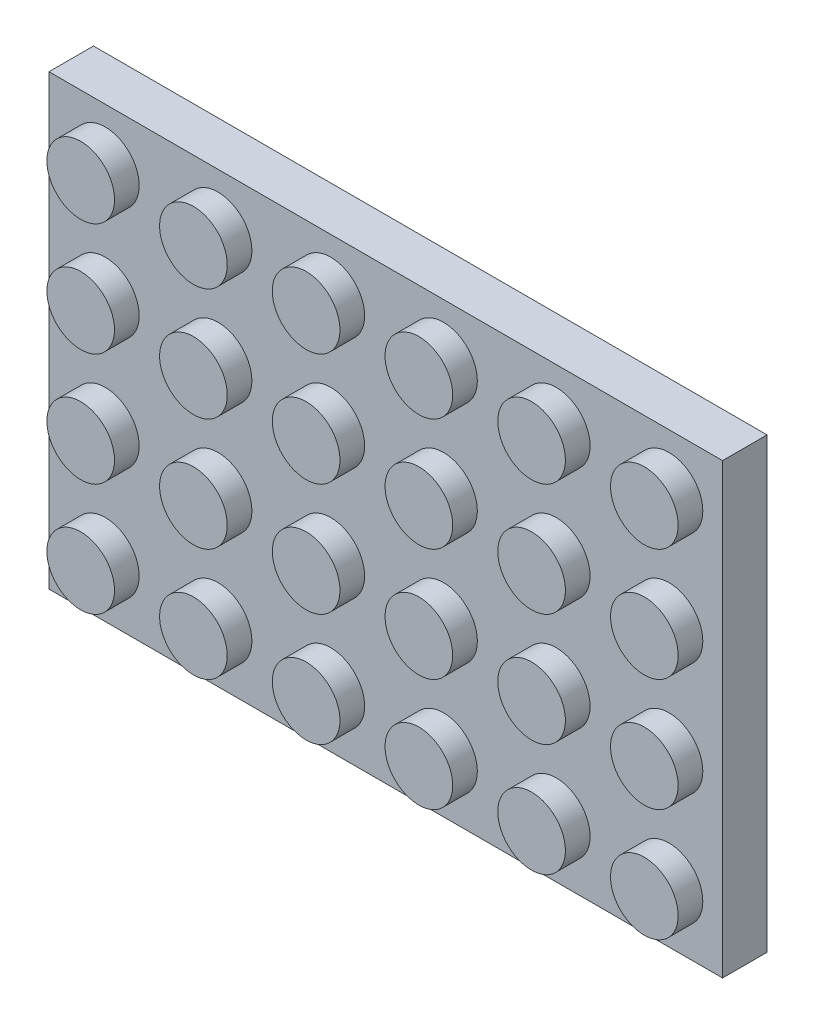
from build123d import *

# Parameters (mm, degrees)
SKETCH_1_W                  = 47.8
SKETCH_1_H                  = 31.8
EXTRUDE_972_DEPTH           = 3.16
SKETCH_2_R                  = 2.4
EXTRUDE_1_DEPTH             = 1.75
PATTERN_LINEAR_1_COUNT      = 6
PATTERN_LINEAR_1_PITCH      = 8
PATTERN_LINEAR_1_COUNT_DIR2 = 4
PATTERN_LINEAR_1_PITCH_DIR2 = 8
SKETCH_3_W                  = 44.8
SKETCH_3_H                  = 28.8
CUT_EXTRUDE_1_DEPTH         = 2
SKETCH_4_R                  = 3.25
SKETCH_4_R_2                = 2.5
EXTRUDE_2_DEPTH             = 2
LPATTERN1_COUNT             = 5
LPATTERN1_PITCH             = 8
LPATTERN2_COUNT             = 3
LPATTERN2_PITCH             = 8
LPATTERN2_COPY_1_SKETCH_R   = 3.25
LPATTERN2_COPY_1_SKETCH_R_2 = 2.5
LPATTERN2_COPY_1_DEPTH      = 2
LPATTERN2_COPY_2_SKETCH_R   = 3.25
LPATTERN2_COPY_2_SKETCH_R_2 = 2.5
LPATTERN2_COPY_2_DEPTH      = 2
LPATTERN2_COPY_3_SKETCH_R   = 3.25
LPATTERN2_COPY_3_SKETCH_R_2 = 2.5
LPATTERN2_COPY_3_DEPTH      = 2
LPATTERN2_COPY_4_SKETCH_R   = 3.25
LPATTERN2_COPY_4_SKETCH_R_2 = 2.5
LPATTERN2_COPY_4_DEPTH      = 2
LPATTERN2_COPY_5_SKETCH_R   = 3.25
LPATTERN2_COPY_5_SKETCH_R_2 = 2.5
LPATTERN2_COPY_5_DEPTH      = 2
LPATTERN2_COPY_6_SKETCH_R   = 3.25
LPATTERN2_COPY_6_SKETCH_R_2 = 2.5
LPATTERN2_COPY_6_DEPTH      = 2
LPATTERN2_COPY_7_SKETCH_R   = 3.25
LPATTERN2_COPY_7_SKETCH_R_2 = 2.5
LPATTERN2_COPY_7_DEPTH      = 2
LPATTERN2_COPY_8_SKETCH_R   = 3.25
LPATTERN2_COPY_8_SKETCH_R_2 = 2.5
LPATTERN2_COPY_8_DEPTH      = 2


with BuildPart() as part:
    # Sketch 1 → Extrude 972 (new body)
    with BuildSketch(Plane(origin=(0.007312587, -0.1312965, 0), x_dir=(1, 0, 0), z_dir=(0, 0, 1))):
        with Locations((15.315083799, -7.900418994)):
            Rectangle(SKETCH_1_W, SKETCH_1_H)
    extrude(amount=-EXTRUDE_972_DEPTH)

    # Sketch 2 → Extrude 1 (add)
    with BuildSketch(Plane.XY):
        with Locations((-4.577603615, -19.931715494)):
            Circle(SKETCH_2_R)
    extrude_1 = extrude(amount=EXTRUDE_1_DEPTH)

    # Pattern Linear 1: Extrude 1 6 × 4
    with Locations(*[(i * PATTERN_LINEAR_1_PITCH, j * PATTERN_LINEAR_1_PITCH_DIR2, 0) for i in range(PATTERN_LINEAR_1_COUNT) for j in range(PATTERN_LINEAR_1_COUNT_DIR2) if (i, j) != (0, 0)]):
        add(extrude_1)

    # Sketch 3 → Cut-Extrude 1 (cut)
    with BuildSketch(Plane(origin=(0, 0, -3.16), x_dir=(-1, 0, 0), z_dir=(0, 0, -1))):
        with Locations((-15.322396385, -8.031715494)):
            Rectangle(SKETCH_3_W, SKETCH_3_H)
    extrude(amount=-CUT_EXTRUDE_1_DEPTH, mode=Mode.SUBTRACT)

    # Sketch 4 → Extrude 2 (add)
    with BuildSketch(Plane(origin=(0, 0, -1.16), x_dir=(-1, 0, 0), z_dir=(0, 0, -1))):
        with Locations((0.577603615, -15.931715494)):
            Circle(SKETCH_4_R)
        with Locations((0.577603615, -15.931715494)):
            Circle(SKETCH_4_R_2, mode=Mode.SUBTRACT)
    extrude_2 = extrude(amount=EXTRUDE_2_DEPTH)

    # LPattern1: Extrude 2 ×5
    with Locations(*[(i * LPATTERN1_PITCH, 0, 0) for i in range(1, LPATTERN1_COUNT)]):
        add(extrude_2)

    # LPattern2: Extrude 2 ×3
    with Locations(*[(0, i * LPATTERN2_PITCH, 0) for i in range(1, LPATTERN2_COUNT)]):
        add(extrude_2)

    # LPattern2 copy 1 sketch → LPattern2 copy 1 (add)
    with BuildSketch(Plane(origin=(8, 8, -1.16), x_dir=(-1, 0, 0), z_dir=(0, 0, -1))):
        with Locations((0.577603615, -15.931715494)):
            Circle(LPATTERN2_COPY_1_SKETCH_R)
        with Locations((0.577603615, -15.931715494)):
            Circle(LPATTERN2_COPY_1_SKETCH_R_2, mode=Mode.SUBTRACT)
    extrude(amount=LPATTERN2_COPY_1_DEPTH)

    # LPattern2 copy 2 sketch → LPattern2 copy 2 (add)
    with BuildSketch(Plane(origin=(8, 16, -1.16), x_dir=(-1, 0, 0), z_dir=(0, 0, -1))):
        with Locations((0.577603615, -15.931715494)):
            Circle(LPATTERN2_COPY_2_SKETCH_R)
        with Locations((0.577603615, -15.931715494)):
            Circle(LPATTERN2_COPY_2_SKETCH_R_2, mode=Mode.SUBTRACT)
    extrude(amount=LPATTERN2_COPY_2_DEPTH)

    # LPattern2 copy 3 sketch → LPattern2 copy 3 (add)
    with BuildSketch(Plane(origin=(16, 8, -1.16), x_dir=(-1, 0, 0), z_dir=(0, 0, -1))):
        with Locations((0.577603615, -15.931715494)):
            Circle(LPATTERN2_COPY_3_SKETCH_R)
        with Locations((0.577603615, -15.931715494)):
            Circle(LPATTERN2_COPY_3_SKETCH_R_2, mode=Mode.SUBTRACT)
    extrude(amount=LPATTERN2_COPY_3_DEPTH)

    # LPattern2 copy 4 sketch → LPattern2 copy 4 (add)
    with BuildSketch(Plane(origin=(16, 16, -1.16), x_dir=(-1, 0, 0), z_dir=(0, 0, -1))):
        with Locations((0.577603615, -15.931715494)):
            Circle(LPATTERN2_COPY_4_SKETCH_R)
        with Locations((0.577603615, -15.931715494)):
            Circle(LPATTERN2_COPY_4_SKETCH_R_2, mode=Mode.SUBTRACT)
    extrude(amount=LPATTERN2_COPY_4_DEPTH)

    # LPattern2 copy 5 sketch → LPattern2 copy 5 (add)
    with BuildSketch(Plane(origin=(24, 8, -1.16), x_dir=(-1, 0, 0), z_dir=(0, 0, -1))):
        with Locations((0.577603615, -15.931715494)):
            Circle(LPATTERN2_COPY_5_SKETCH_R)
        with Locations((0.577603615, -15.931715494)):
            Circle(LPATTERN2_COPY_5_SKETCH_R_2, mode=Mode.SUBTRACT)
    extrude(amount=LPATTERN2_COPY_5_DEPTH)

    # LPattern2 copy 6 sketch → LPattern2 copy 6 (add)
    with BuildSketch(Plane(origin=(24, 16, -1.16), x_dir=(-1, 0, 0), z_dir=(0, 0, -1))):
        with Locations((0.577603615, -15.931715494)):
            Circle(LPATTERN2_COPY_6_SKETCH_R)
        with Locations((0.577603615, -15.931715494)):
            Circle(LPATTERN2_COPY_6_SKETCH_R_2, mode=Mode.SUBTRACT)
    extrude(amount=LPATTERN2_COPY_6_DEPTH)

    # LPattern2 copy 7 sketch → LPattern2 copy 7 (add)
    with BuildSketch(Plane(origin=(32, 8, -1.16), x_dir=(-1, 0, 0), z_dir=(0, 0, -1))):
        with Locations((0.577603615, -15.931715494)):
            Circle(LPATTERN2_COPY_7_SKETCH_R)
        with Locations((0.577603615, -15.931715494)):
            Circle(LPATTERN2_COPY_7_SKETCH_R_2, mode=Mode.SUBTRACT)
    extrude(amount=LPATTERN2_COPY_7_DEPTH)

    # LPattern2 copy 8 sketch → LPattern2 copy 8 (add)
    with BuildSketch(Plane(origin=(32, 16, -1.16), x_dir=(-1, 0, 0), z_dir=(0, 0, -1))):
        with Locations((0.577603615, -15.931715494)):
            Circle(LPATTERN2_COPY_8_SKETCH_R)
        with Locations((0.577603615, -15.931715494)):
            Circle(LPATTERN2_COPY_8_SKETCH_R_2, mode=Mode.SUBTRACT)
    extrude(amount=LPATTERN2_COPY_8_DEPTH)


solid = part.part
